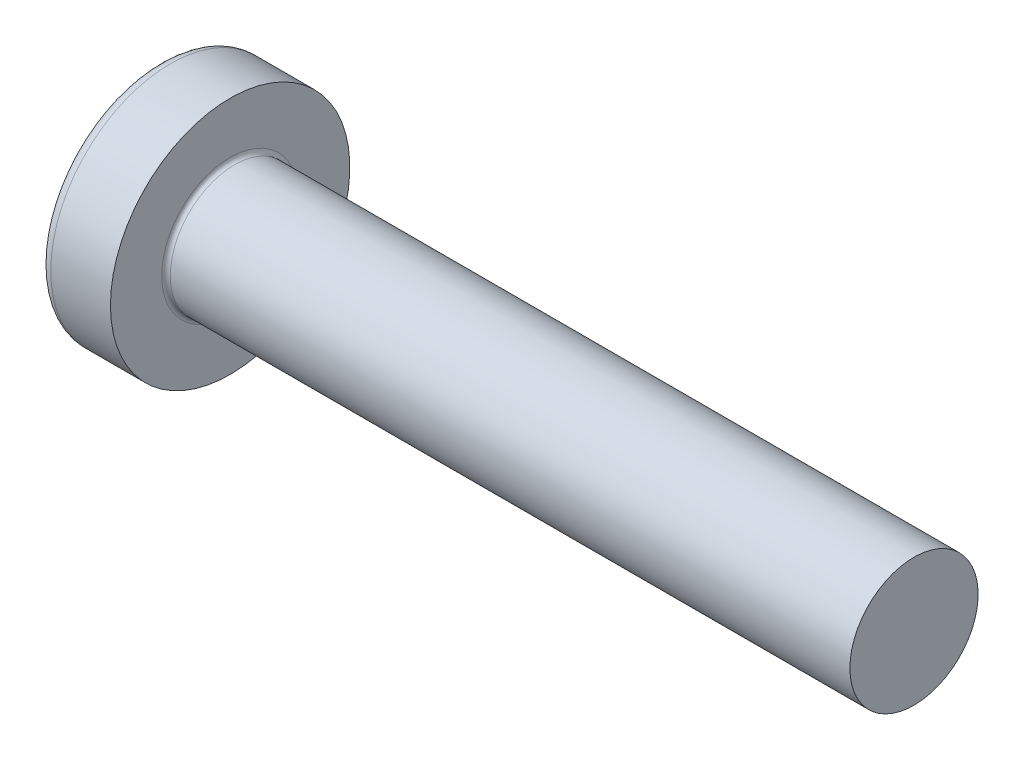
from build123d import *

# Parameters (mm, degrees)
FILLET1_R    = 0.1
RECPAT_COUNT = 2
RECPAT_ANGLE = 90


with BuildPart() as part:
    # BodySke → Base-Revolve (revolve)
    with BuildSketch(Plane.XY, mode=Mode.PRIVATE) as base_revolve_sk:
        with BuildLine():
            Line((2.4, 1.5), (2.4, 2.8))
            Line((2.4, 2.8), (1.003501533, 2.8))
            ThreePointArc((1.003501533, 2.8), (0.873295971, 2.76653015), (0.775371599, 2.674418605))
            ThreePointArc((0.775371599, 2.674418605), (0.197753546, 1.392274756), (0, 0))
            Line((0, 0), (18.4, 0))
            Line((18.4, 0), (18.4, 1.5))
            Line((18.4, 1.5), (2.4, 1.5))
        make_face()
    revolve(base_revolve_sk.sketch.rotate(Axis((1.003501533, 0, 0), (1, 0, 0)), 90), axis=Axis((1.003501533, 0, 0), (1, 0, 0)))

    # Fillet1
    fillet1_edges = [part.edges().sort_by_distance(p)[0] for p in [
        (2.4, 0, -1.5),
    ]]
    fillet(fillet1_edges, radius=FILLET1_R)

    # Sketch3 → Recess section 0
    with BuildSketch(Plane(origin=(0, 0, 0), x_dir=(0, 0, -1), z_dir=(1, 0, 0))):
        with BuildLine():
            Line((0.37, -1.4), (-0.37, -1.4))
            Line((-0.37, -1.4), (-0.37, 1.4))
            Line((-0.37, 1.4), (0.37, 1.4))
            Line((0.37, 1.4), (0.37, -1.4))
        make_face()
    # Sketch4 → Recess section 1
    with BuildSketch(Plane(origin=(1.75, 0, 0), x_dir=(0, 0, -1), z_dir=(1, 0, 0))):
        with BuildLine():
            Line((0.37, -0.527482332), (-0.37, -0.527482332))
            Line((-0.37, -0.527482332), (-0.37, 0.527482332))
            Line((-0.37, 0.527482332), (0.37, 0.527482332))
            Line((0.37, 0.527482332), (0.37, -0.527482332))
        make_face()
    recess = loft(mode=Mode.SUBTRACT)

    # RecPat: Recess ×2 about axis
    recpat_axis = Axis((0, 0, 0), (1, 0, 0))
    for i in range(1, RECPAT_COUNT):
        add(recess.rotate(recpat_axis, i * RECPAT_ANGLE / (RECPAT_COUNT - 1)), mode=Mode.SUBTRACT)

    # RecCorSke → RecessCore (revolve, cut)
    with BuildSketch(Plane.XY, mode=Mode.PRIVATE) as recesscore_sk:
        Polygon((0, 0), (0, 0.678371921), (1.75, 0.556), (1.930655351, 0), align=None)
    revolve(recesscore_sk.sketch.rotate(Axis((-3.175, 0, 0), (1, 0, 0)), 15.814025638), axis=Axis((-3.175, 0, 0), (1, 0, 0)), mode=Mode.SUBTRACT)


solid = part.part
